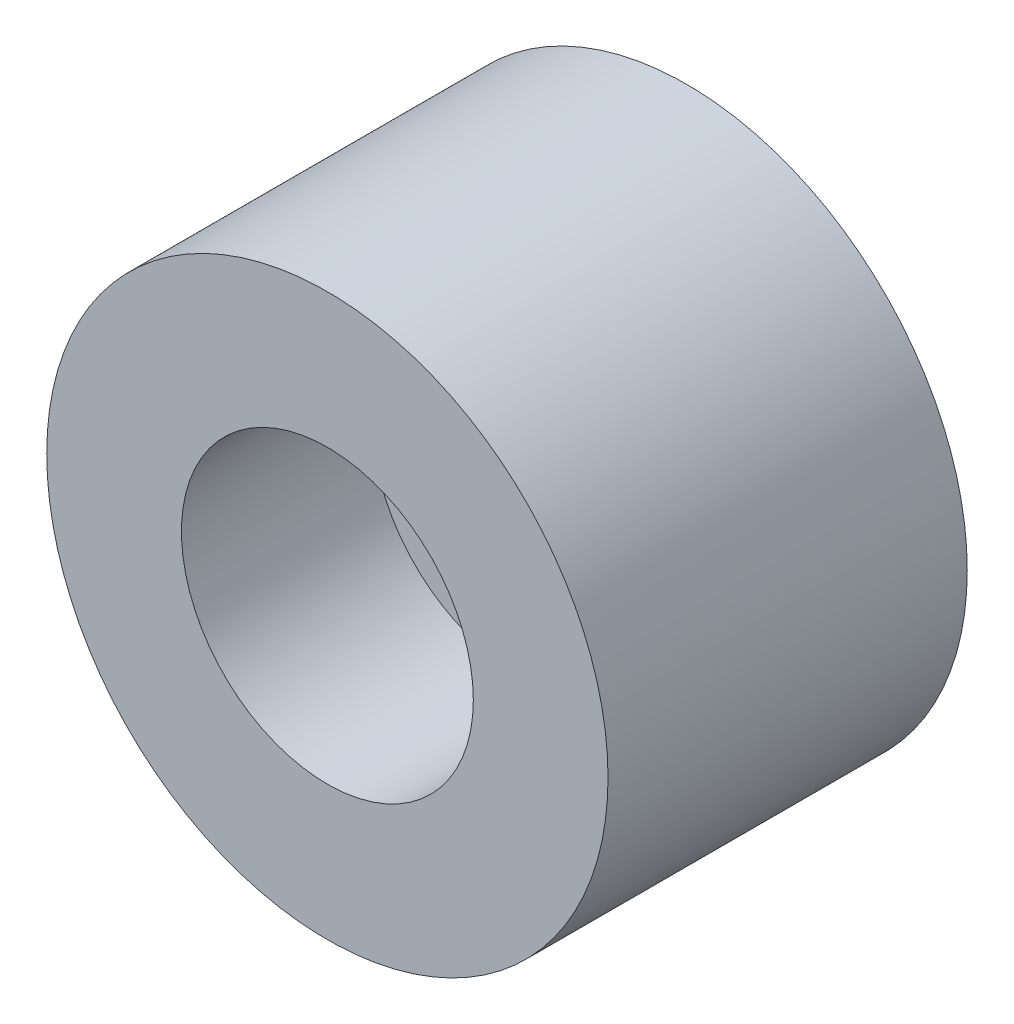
ISO-10303-21;
HEADER;
FILE_DESCRIPTION(('STEP AP214'),'2;1');
FILE_NAME('part.step','',(''),(''),'','','');
FILE_SCHEMA(('AUTOMOTIVE_DESIGN { 1 0 10303 214 1 1 1 1 }'));
ENDSEC;
DATA;
#1=APPLICATION_CONTEXT('core data for automotive mechanical design processes');
#2=APPLICATION_PROTOCOL_DEFINITION('international standard','automotive_design',2000,#1);
#3=PRODUCT_CONTEXT('',#1,'mechanical');
#4=PRODUCT('Part','Part','',(#3));
#5=PRODUCT_RELATED_PRODUCT_CATEGORY('part','',(#4));
#6=PRODUCT_DEFINITION_FORMATION('','',#4);
#7=PRODUCT_DEFINITION_CONTEXT('part definition',#1,'design');
#8=PRODUCT_DEFINITION('design','',#6,#7);
#9=PRODUCT_DEFINITION_SHAPE('','',#8);
#10=(LENGTH_UNIT() NAMED_UNIT(*) SI_UNIT(.MILLI.,.METRE.));
#11=(NAMED_UNIT(*) PLANE_ANGLE_UNIT() SI_UNIT($,.RADIAN.));
#12=(NAMED_UNIT(*) SI_UNIT($,.STERADIAN.) SOLID_ANGLE_UNIT());
#13=UNCERTAINTY_MEASURE_WITH_UNIT(LENGTH_MEASURE(1.E-05),#10,'distance_accuracy_value','');
#14=(GEOMETRIC_REPRESENTATION_CONTEXT(3) GLOBAL_UNCERTAINTY_ASSIGNED_CONTEXT((#13)) GLOBAL_UNIT_ASSIGNED_CONTEXT((#10,
#11,#12)) REPRESENTATION_CONTEXT('',''));
#15=CARTESIAN_POINT('',(0.,0.,0.));
#16=DIRECTION('',(0.,0.,1.));
#17=DIRECTION('',(1.,0.,0.));
#18=AXIS2_PLACEMENT_3D('',#15,#16,#17);
#19=CARTESIAN_POINT('',(13.,0.,15.));
#20=DIRECTION('',(0.,0.,-1.));
#21=DIRECTION('',(-1.,0.,0.));
#22=AXIS2_PLACEMENT_3D('',#19,#20,#21);
#23=PLANE('',#22);
#24=CARTESIAN_POINT('',(0.,0.,15.));
#25=DIRECTION('',(0.,0.,1.));
#26=DIRECTION('',(1.,0.,0.));
#27=AXIS2_PLACEMENT_3D('',#24,#25,#26);
#28=CIRCLE('',#27,9.);
#29=CARTESIAN_POINT('',(9.,0.,15.));
#30=VERTEX_POINT('',#29);
#31=EDGE_CURVE('E8',#30,#30,#28,.T.);
#32=ORIENTED_EDGE('',*,*,#31,.F.);
#33=EDGE_LOOP('',(#32));
#34=FACE_BOUND('',#33,.T.);
#35=CARTESIAN_POINT('',(0.,0.,15.));
#36=DIRECTION('',(0.,0.,1.));
#37=DIRECTION('',(1.,0.,0.));
#38=AXIS2_PLACEMENT_3D('',#35,#36,#37);
#39=CIRCLE('',#38,13.);
#40=CARTESIAN_POINT('',(13.,0.,15.));
#41=VERTEX_POINT('',#40);
#42=EDGE_CURVE('E34',#41,#41,#39,.T.);
#43=ORIENTED_EDGE('',*,*,#42,.T.);
#44=EDGE_LOOP('',(#43));
#45=FACE_BOUND('',#44,.T.);
#46=ADVANCED_FACE('F12',(#34,#45),#23,.F.);
#47=CARTESIAN_POINT('',(0.,0.,40.));
#48=DIRECTION('',(0.,0.,1.));
#49=DIRECTION('',(1.,0.,0.));
#50=AXIS2_PLACEMENT_3D('',#47,#48,#49);
#51=CYLINDRICAL_SURFACE('',#50,9.);
#52=CARTESIAN_POINT('',(0.,0.,0.));
#53=DIRECTION('',(0.,0.,1.));
#54=DIRECTION('',(1.,0.,0.));
#55=AXIS2_PLACEMENT_3D('',#52,#53,#54);
#56=CIRCLE('',#55,9.);
#57=CARTESIAN_POINT('',(9.,0.,0.));
#58=VERTEX_POINT('',#57);
#59=EDGE_CURVE('E18',#58,#58,#56,.T.);
#60=ORIENTED_EDGE('',*,*,#59,.F.);
#61=EDGE_LOOP('',(#60));
#62=FACE_BOUND('',#61,.T.);
#63=ORIENTED_EDGE('',*,*,#31,.T.);
#64=EDGE_LOOP('',(#63));
#65=FACE_BOUND('',#64,.T.);
#66=ADVANCED_FACE('F59',(#62,#65),#51,.F.);
#67=CARTESIAN_POINT('',(9.,0.,0.));
#68=DIRECTION('',(0.,0.,1.));
#69=DIRECTION('',(1.,0.,0.));
#70=AXIS2_PLACEMENT_3D('',#67,#68,#69);
#71=PLANE('',#70);
#72=CARTESIAN_POINT('',(0.,0.,0.));
#73=DIRECTION('',(0.,0.,1.));
#74=DIRECTION('',(1.,0.,0.));
#75=AXIS2_PLACEMENT_3D('',#72,#73,#74);
#76=CIRCLE('',#75,25.);
#77=CARTESIAN_POINT('',(25.,0.,0.));
#78=VERTEX_POINT('',#77);
#79=EDGE_CURVE('E22',#78,#78,#76,.T.);
#80=ORIENTED_EDGE('',*,*,#79,.F.);
#81=EDGE_LOOP('',(#80));
#82=FACE_BOUND('',#81,.T.);
#83=ORIENTED_EDGE('',*,*,#59,.T.);
#84=EDGE_LOOP('',(#83));
#85=FACE_BOUND('',#84,.T.);
#86=ADVANCED_FACE('F54',(#82,#85),#71,.F.);
#87=CARTESIAN_POINT('',(0.,0.,40.));
#88=DIRECTION('',(0.,0.,1.));
#89=DIRECTION('',(1.,0.,0.));
#90=AXIS2_PLACEMENT_3D('',#87,#88,#89);
#91=CYLINDRICAL_SURFACE('',#90,25.);
#92=CARTESIAN_POINT('',(0.,0.,32.));
#93=DIRECTION('',(0.,0.,1.));
#94=DIRECTION('',(1.,0.,0.));
#95=AXIS2_PLACEMENT_3D('',#92,#93,#94);
#96=CIRCLE('',#95,25.);
#97=CARTESIAN_POINT('',(25.,0.,32.));
#98=VERTEX_POINT('',#97);
#99=EDGE_CURVE('E26',#98,#98,#96,.T.);
#100=ORIENTED_EDGE('',*,*,#99,.F.);
#101=EDGE_LOOP('',(#100));
#102=FACE_BOUND('',#101,.T.);
#103=ORIENTED_EDGE('',*,*,#79,.T.);
#104=EDGE_LOOP('',(#103));
#105=FACE_BOUND('',#104,.T.);
#106=ADVANCED_FACE('F48',(#102,#105),#91,.T.);
#107=CARTESIAN_POINT('',(25.,0.,32.));
#108=DIRECTION('',(0.,0.,-1.));
#109=DIRECTION('',(-1.,0.,0.));
#110=AXIS2_PLACEMENT_3D('',#107,#108,#109);
#111=PLANE('',#110);
#112=CARTESIAN_POINT('',(0.,0.,32.));
#113=DIRECTION('',(0.,0.,1.));
#114=DIRECTION('',(1.,0.,0.));
#115=AXIS2_PLACEMENT_3D('',#112,#113,#114);
#116=CIRCLE('',#115,13.);
#117=CARTESIAN_POINT('',(13.,0.,32.));
#118=VERTEX_POINT('',#117);
#119=EDGE_CURVE('E31',#118,#118,#116,.T.);
#120=ORIENTED_EDGE('',*,*,#119,.F.);
#121=EDGE_LOOP('',(#120));
#122=FACE_BOUND('',#121,.T.);
#123=ORIENTED_EDGE('',*,*,#99,.T.);
#124=EDGE_LOOP('',(#123));
#125=FACE_BOUND('',#124,.T.);
#126=ADVANCED_FACE('F42',(#122,#125),#111,.F.);
#127=CARTESIAN_POINT('',(0.,0.,40.));
#128=DIRECTION('',(0.,0.,1.));
#129=DIRECTION('',(1.,0.,0.));
#130=AXIS2_PLACEMENT_3D('',#127,#128,#129);
#131=CYLINDRICAL_SURFACE('',#130,13.);
#132=ORIENTED_EDGE('',*,*,#42,.F.);
#133=EDGE_LOOP('',(#132));
#134=FACE_BOUND('',#133,.T.);
#135=ORIENTED_EDGE('',*,*,#119,.T.);
#136=EDGE_LOOP('',(#135));
#137=FACE_BOUND('',#136,.T.);
#138=ADVANCED_FACE('F39',(#134,#137),#131,.F.);
#139=CLOSED_SHELL('',(#46,#66,#86,#106,#126,#138));
#140=MANIFOLD_SOLID_BREP('B1',#139);
#141=ADVANCED_BREP_SHAPE_REPRESENTATION('',(#18,#140),#14);
#142=SHAPE_DEFINITION_REPRESENTATION(#9,#141);
ENDSEC;
END-ISO-10303-21;
